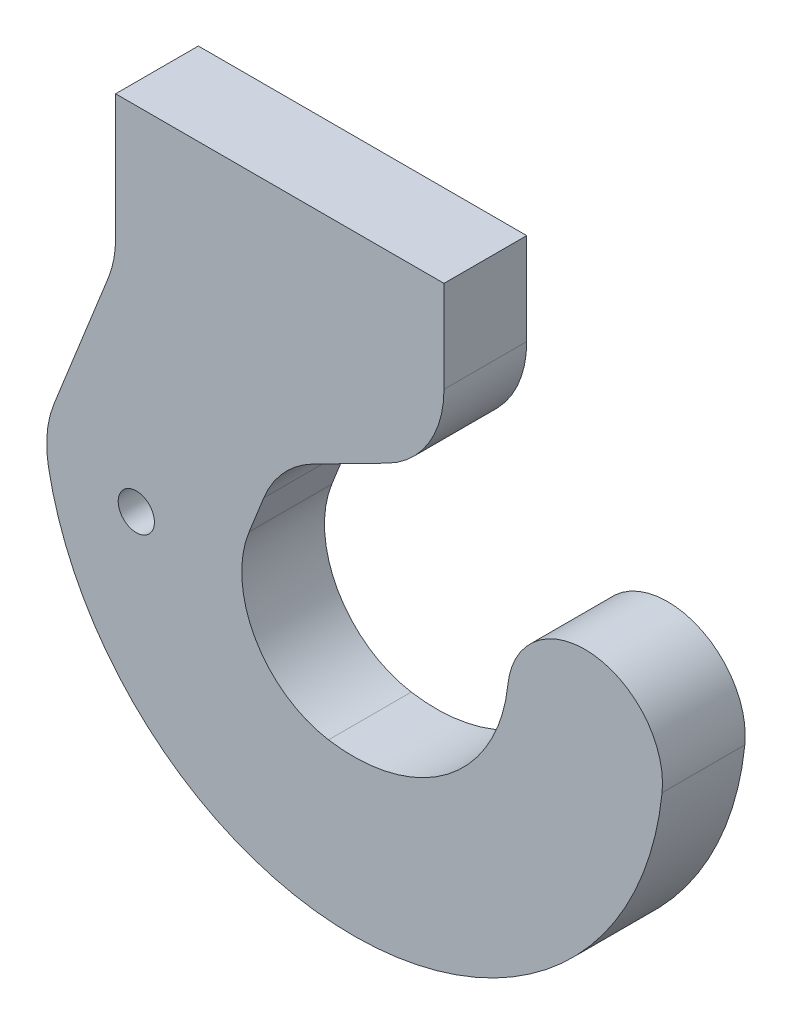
ISO-10303-21;
HEADER;
FILE_DESCRIPTION(('STEP AP214'),'2;1');
FILE_NAME('part.step','',(''),(''),'','','');
FILE_SCHEMA(('AUTOMOTIVE_DESIGN { 1 0 10303 214 1 1 1 1 }'));
ENDSEC;
DATA;
#1=APPLICATION_CONTEXT('core data for automotive mechanical design processes');
#2=APPLICATION_PROTOCOL_DEFINITION('international standard','automotive_design',2000,#1);
#3=PRODUCT_CONTEXT('',#1,'mechanical');
#4=PRODUCT('Part','Part','',(#3));
#5=PRODUCT_RELATED_PRODUCT_CATEGORY('part','',(#4));
#6=PRODUCT_DEFINITION_FORMATION('','',#4);
#7=PRODUCT_DEFINITION_CONTEXT('part definition',#1,'design');
#8=PRODUCT_DEFINITION('design','',#6,#7);
#9=PRODUCT_DEFINITION_SHAPE('','',#8);
#10=(LENGTH_UNIT() NAMED_UNIT(*) SI_UNIT(.MILLI.,.METRE.));
#11=(NAMED_UNIT(*) PLANE_ANGLE_UNIT() SI_UNIT($,.RADIAN.));
#12=(NAMED_UNIT(*) SI_UNIT($,.STERADIAN.) SOLID_ANGLE_UNIT());
#13=UNCERTAINTY_MEASURE_WITH_UNIT(LENGTH_MEASURE(1.E-05),#10,'distance_accuracy_value','');
#14=(GEOMETRIC_REPRESENTATION_CONTEXT(3) GLOBAL_UNCERTAINTY_ASSIGNED_CONTEXT((#13)) GLOBAL_UNIT_ASSIGNED_CONTEXT((#10,
#11,#12)) REPRESENTATION_CONTEXT('',''));
#15=CARTESIAN_POINT('',(0.,0.,0.));
#16=DIRECTION('',(0.,0.,1.));
#17=DIRECTION('',(1.,0.,0.));
#18=AXIS2_PLACEMENT_3D('',#15,#16,#17);
#19=CARTESIAN_POINT('',(8.75000000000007,29.,0.999999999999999));
#20=DIRECTION('',(-1.,0.,0.));
#21=DIRECTION('',(0.,-1.,0.));
#22=AXIS2_PLACEMENT_3D('',#19,#20,#21);
#23=PLANE('',#22);
#24=DIRECTION('',(0.,-1.,0.));
#25=VECTOR('',#24,1.);
#26=CARTESIAN_POINT('',(8.75000000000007,29.,9.));
#27=LINE('',#26,#25);
#28=CARTESIAN_POINT('',(8.75000000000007,29.,9.));
#29=VERTEX_POINT('',#28);
#30=CARTESIAN_POINT('',(8.75000000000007,20.1236294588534,9.));
#31=VERTEX_POINT('',#30);
#32=EDGE_CURVE('E173',#29,#31,#27,.T.);
#33=ORIENTED_EDGE('',*,*,#32,.T.);
#34=DIRECTION('',(0.,0.,1.));
#35=VECTOR('',#34,1.);
#36=CARTESIAN_POINT('',(8.75000000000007,20.1236294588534,0.999999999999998));
#37=LINE('',#36,#35);
#38=CARTESIAN_POINT('',(8.75000000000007,20.1236294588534,0.999999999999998));
#39=VERTEX_POINT('',#38);
#40=EDGE_CURVE('E223',#31,#39,#37,.F.);
#41=ORIENTED_EDGE('',*,*,#40,.T.);
#42=DIRECTION('',(0.,-1.,0.));
#43=VECTOR('',#42,1.);
#44=CARTESIAN_POINT('',(8.75000000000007,29.,0.999999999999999));
#45=LINE('',#44,#43);
#46=CARTESIAN_POINT('',(8.75000000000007,29.,0.999999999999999));
#47=VERTEX_POINT('',#46);
#48=EDGE_CURVE('E194',#47,#39,#45,.T.);
#49=ORIENTED_EDGE('',*,*,#48,.F.);
#50=DIRECTION('',(0.,0.,1.));
#51=VECTOR('',#50,1.);
#52=CARTESIAN_POINT('',(8.75000000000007,29.,0.999999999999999));
#53=LINE('',#52,#51);
#54=EDGE_CURVE('E172',#47,#29,#53,.T.);
#55=ORIENTED_EDGE('',*,*,#54,.T.);
#56=EDGE_LOOP('',(#33,#41,#49,#55));
#57=FACE_BOUND('',#56,.T.);
#58=ADVANCED_FACE('F36',(#57),#23,.F.);
#59=CARTESIAN_POINT('',(-7.2829108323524,5.81796050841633,0.999999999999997));
#60=DIRECTION('',(-0.454557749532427,0.890717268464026,0.));
#61=DIRECTION('',(-0.890717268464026,-0.454557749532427,0.));
#62=AXIS2_PLACEMENT_3D('',#59,#60,#61);
#63=PLANE('',#62);
#64=DIRECTION('',(-0.890717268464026,-0.454557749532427,0.));
#65=VECTOR('',#64,1.);
#66=CARTESIAN_POINT('',(-7.2829108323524,5.81796050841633,0.999999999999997));
#67=LINE('',#66,#65);
#68=CARTESIAN_POINT('',(3.29557749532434,11.2164567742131,0.999999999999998));
#69=VERTEX_POINT('',#68);
#70=CARTESIAN_POINT('',(-3.93249415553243,7.5277711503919,0.999999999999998));
#71=VERTEX_POINT('',#70);
#72=EDGE_CURVE('E286',#69,#71,#67,.T.);
#73=ORIENTED_EDGE('',*,*,#72,.F.);
#74=DIRECTION('',(0.,0.,1.));
#75=VECTOR('',#74,1.);
#76=CARTESIAN_POINT('',(3.29557749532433,11.2164567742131,0.999999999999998));
#77=LINE('',#76,#75);
#78=CARTESIAN_POINT('',(3.29557749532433,11.2164567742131,9.));
#79=VERTEX_POINT('',#78);
#80=EDGE_CURVE('E220',#69,#79,#77,.T.);
#81=ORIENTED_EDGE('',*,*,#80,.T.);
#82=DIRECTION('',(-0.890717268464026,-0.454557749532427,0.));
#83=VECTOR('',#82,1.);
#84=CARTESIAN_POINT('',(-7.2829108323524,5.81796050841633,9.));
#85=LINE('',#84,#83);
#86=CARTESIAN_POINT('',(-3.93249415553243,7.5277711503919,9.));
#87=VERTEX_POINT('',#86);
#88=EDGE_CURVE('E176',#79,#87,#85,.T.);
#89=ORIENTED_EDGE('',*,*,#88,.T.);
#90=DIRECTION('',(0.,0.,1.));
#91=VECTOR('',#90,1.);
#92=CARTESIAN_POINT('',(-3.93249415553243,7.5277711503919,0.999999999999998));
#93=LINE('',#92,#91);
#94=EDGE_CURVE('E218',#87,#71,#93,.F.);
#95=ORIENTED_EDGE('',*,*,#94,.T.);
#96=EDGE_LOOP('',(#73,#81,#89,#95));
#97=FACE_BOUND('',#96,.T.);
#98=ADVANCED_FACE('F258',(#97),#63,.F.);
#99=CARTESIAN_POINT('',(-12.7516213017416,-7.89912363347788,0.999999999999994));
#100=DIRECTION('',(-0.928899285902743,0.370332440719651,0.));
#101=DIRECTION('',(-0.370332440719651,-0.928899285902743,0.));
#102=AXIS2_PLACEMENT_3D('',#99,#100,#101);
#103=PLANE('',#102);
#104=DIRECTION('',(-0.370332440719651,-0.928899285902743,0.));
#105=VECTOR('',#104,1.);
#106=CARTESIAN_POINT('',(-12.7516213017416,-7.89912363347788,0.999999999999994));
#107=LINE('',#106,#105);
#108=CARTESIAN_POINT('',(-8.67590951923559,2.32392287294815,0.999999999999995));
#109=VERTEX_POINT('',#108);
#110=CARTESIAN_POINT('',(-10.093398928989,-1.23154447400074,0.999999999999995));
#111=VERTEX_POINT('',#110);
#112=EDGE_CURVE('E145',#109,#111,#107,.T.);
#113=ORIENTED_EDGE('',*,*,#112,.F.);
#114=DIRECTION('',(0.,0.,1.));
#115=VECTOR('',#114,1.);
#116=CARTESIAN_POINT('',(-8.67590951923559,2.32392287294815,8.99999999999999));
#117=LINE('',#116,#115);
#118=CARTESIAN_POINT('',(-8.67590951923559,2.32392287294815,9.));
#119=VERTEX_POINT('',#118);
#120=EDGE_CURVE('E226',#109,#119,#117,.T.);
#121=ORIENTED_EDGE('',*,*,#120,.T.);
#122=DIRECTION('',(-0.370332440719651,-0.928899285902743,0.));
#123=VECTOR('',#122,1.);
#124=CARTESIAN_POINT('',(-12.7516213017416,-7.89912363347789,8.99999999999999));
#125=LINE('',#124,#123);
#126=CARTESIAN_POINT('',(-10.093398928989,-1.23154447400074,8.99999999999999));
#127=VERTEX_POINT('',#126);
#128=EDGE_CURVE('E179',#119,#127,#125,.T.);
#129=ORIENTED_EDGE('',*,*,#128,.T.);
#130=DIRECTION('',(0.,0.,-1.));
#131=VECTOR('',#130,1.);
#132=CARTESIAN_POINT('',(-10.093398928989,-1.23154447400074,0.999999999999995));
#133=LINE('',#132,#131);
#134=EDGE_CURVE('E58',#127,#111,#133,.T.);
#135=ORIENTED_EDGE('',*,*,#134,.T.);
#136=EDGE_LOOP('',(#113,#121,#129,#135));
#137=FACE_BOUND('',#136,.T.);
#138=ADVANCED_FACE('F244',(#137),#103,.F.);
#139=CARTESIAN_POINT('',(0.,0.,0.999999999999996));
#140=DIRECTION('',(0.,0.,1.));
#141=DIRECTION('',(0.,-1.,0.));
#142=AXIS2_PLACEMENT_3D('',#139,#140,#141);
#143=CYLINDRICAL_SURFACE('',#142,15.);
#144=CARTESIAN_POINT('',(0.,0.,0.999999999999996));
#145=DIRECTION('',(0.,0.,1.));
#146=DIRECTION('',(0.,1.,0.));
#147=AXIS2_PLACEMENT_3D('',#144,#145,#146);
#148=CIRCLE('',#147,15.);
#149=CARTESIAN_POINT('',(-2.41321820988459,-14.8046066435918,0.999999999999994));
#150=VERTEX_POINT('',#149);
#151=CARTESIAN_POINT('',(14.9193145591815,-1.5537223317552,0.999999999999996));
#152=VERTEX_POINT('',#151);
#153=EDGE_CURVE('E135',#150,#152,#148,.T.);
#154=ORIENTED_EDGE('',*,*,#153,.F.);
#155=DIRECTION('',(0.,0.,1.));
#156=VECTOR('',#155,1.);
#157=CARTESIAN_POINT('',(-2.41321820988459,-14.8046066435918,0.999999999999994));
#158=LINE('',#157,#156);
#159=CARTESIAN_POINT('',(-2.41321820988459,-14.8046066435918,8.99999999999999));
#160=VERTEX_POINT('',#159);
#161=EDGE_CURVE('E229',#150,#160,#158,.T.);
#162=ORIENTED_EDGE('',*,*,#161,.T.);
#163=CARTESIAN_POINT('',(0.,0.,9.));
#164=DIRECTION('',(0.,0.,1.));
#165=DIRECTION('',(0.,1.,0.));
#166=AXIS2_PLACEMENT_3D('',#163,#164,#165);
#167=CIRCLE('',#166,15.);
#168=CARTESIAN_POINT('',(14.9193145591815,-1.5537223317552,9.));
#169=VERTEX_POINT('',#168);
#170=EDGE_CURVE('E151',#160,#169,#167,.T.);
#171=ORIENTED_EDGE('',*,*,#170,.T.);
#172=DIRECTION('',(0.,0.,1.));
#173=VECTOR('',#172,1.);
#174=CARTESIAN_POINT('',(14.9193145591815,-1.5537223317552,0.999999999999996));
#175=LINE('',#174,#173);
#176=EDGE_CURVE('E148',#152,#169,#175,.T.);
#177=ORIENTED_EDGE('',*,*,#176,.F.);
#178=EDGE_LOOP('',(#154,#162,#171,#177));
#179=FACE_BOUND('',#178,.T.);
#180=ADVANCED_FACE('F149',(#179),#143,.F.);
#181=CARTESIAN_POINT('',(22.3789718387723,-2.33058349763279,0.999999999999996));
#182=DIRECTION('',(0.,0.,1.));
#183=DIRECTION('',(0.,-1.,0.));
#184=AXIS2_PLACEMENT_3D('',#181,#182,#183);
#185=CYLINDRICAL_SURFACE('',#184,7.5);
#186=CARTESIAN_POINT('',(22.3789718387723,-2.33058349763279,9.));
#187=DIRECTION('',(0.,0.,-1.));
#188=DIRECTION('',(0.,1.,0.));
#189=AXIS2_PLACEMENT_3D('',#186,#187,#188);
#190=CIRCLE('',#189,7.5);
#191=CARTESIAN_POINT('',(29.838629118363,-3.10744466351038,9.));
#192=VERTEX_POINT('',#191);
#193=EDGE_CURVE('E182',#169,#192,#190,.T.);
#194=ORIENTED_EDGE('',*,*,#193,.T.);
#195=DIRECTION('',(0.,0.,1.));
#196=VECTOR('',#195,1.);
#197=CARTESIAN_POINT('',(29.838629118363,-3.10744466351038,0.999999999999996));
#198=LINE('',#197,#196);
#199=CARTESIAN_POINT('',(29.838629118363,-3.10744466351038,0.999999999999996));
#200=VERTEX_POINT('',#199);
#201=EDGE_CURVE('E155',#200,#192,#198,.T.);
#202=ORIENTED_EDGE('',*,*,#201,.F.);
#203=CARTESIAN_POINT('',(22.3789718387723,-2.33058349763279,0.999999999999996));
#204=DIRECTION('',(0.,0.,-1.));
#205=DIRECTION('',(0.,1.,0.));
#206=AXIS2_PLACEMENT_3D('',#203,#204,#205);
#207=CIRCLE('',#206,7.5);
#208=EDGE_CURVE('E140',#152,#200,#207,.T.);
#209=ORIENTED_EDGE('',*,*,#208,.F.);
#210=ORIENTED_EDGE('',*,*,#176,.T.);
#211=EDGE_LOOP('',(#194,#202,#209,#210));
#212=FACE_BOUND('',#211,.T.);
#213=ADVANCED_FACE('F157',(#212),#185,.T.);
#214=CARTESIAN_POINT('',(0.,0.,0.999999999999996));
#215=DIRECTION('',(0.,0.,1.));
#216=DIRECTION('',(0.,-1.,0.));
#217=AXIS2_PLACEMENT_3D('',#214,#215,#216);
#218=CYLINDRICAL_SURFACE('',#217,30.);
#219=CARTESIAN_POINT('',(0.,0.,9.));
#220=DIRECTION('',(0.,0.,-1.));
#221=DIRECTION('',(0.,1.,0.));
#222=AXIS2_PLACEMENT_3D('',#219,#220,#221);
#223=CIRCLE('',#222,30.);
#224=CARTESIAN_POINT('',(-29.4989427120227,-5.46007132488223,9.));
#225=VERTEX_POINT('',#224);
#226=EDGE_CURVE('E184',#192,#225,#223,.T.);
#227=ORIENTED_EDGE('',*,*,#226,.T.);
#228=DIRECTION('',(0.,0.,1.));
#229=VECTOR('',#228,1.);
#230=CARTESIAN_POINT('',(-29.4989427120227,-5.46007132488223,0.999999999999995));
#231=LINE('',#230,#229);
#232=CARTESIAN_POINT('',(-29.4989427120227,-5.46007132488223,0.999999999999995));
#233=VERTEX_POINT('',#232);
#234=EDGE_CURVE('E212',#225,#233,#231,.F.);
#235=ORIENTED_EDGE('',*,*,#234,.T.);
#236=CARTESIAN_POINT('',(0.,0.,0.999999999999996));
#237=DIRECTION('',(0.,0.,-1.));
#238=DIRECTION('',(0.,1.,0.));
#239=AXIS2_PLACEMENT_3D('',#236,#237,#238);
#240=CIRCLE('',#239,30.);
#241=EDGE_CURVE('E160',#200,#233,#240,.T.);
#242=ORIENTED_EDGE('',*,*,#241,.F.);
#243=ORIENTED_EDGE('',*,*,#201,.T.);
#244=EDGE_LOOP('',(#227,#235,#242,#243));
#245=FACE_BOUND('',#244,.T.);
#246=ADVANCED_FACE('F320',(#245),#218,.T.);
#247=CARTESIAN_POINT('',(-29.9093360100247,-2.33058349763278,0.999999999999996));
#248=DIRECTION('',(0.928899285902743,-0.370332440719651,0.));
#249=DIRECTION('',(0.370332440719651,0.928899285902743,0.));
#250=AXIS2_PLACEMENT_3D('',#247,#248,#249);
#251=PLANE('',#250);
#252=DIRECTION('',(0.370332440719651,0.928899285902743,0.));
#253=VECTOR('',#252,1.);
#254=CARTESIAN_POINT('',(-29.9093360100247,-2.33058349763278,9.));
#255=LINE('',#254,#253);
#256=CARTESIAN_POINT('',(-28.9549546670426,0.0632768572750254,9.));
#257=VERTEX_POINT('',#256);
#258=CARTESIAN_POINT('',(-23.7110071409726,13.216591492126,9.));
#259=VERTEX_POINT('',#258);
#260=EDGE_CURVE('E187',#257,#259,#255,.T.);
#261=ORIENTED_EDGE('',*,*,#260,.T.);
#262=DIRECTION('',(0.,0.,1.));
#263=VECTOR('',#262,1.);
#264=CARTESIAN_POINT('',(-23.7110071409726,13.216591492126,0.999999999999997));
#265=LINE('',#264,#263);
#266=CARTESIAN_POINT('',(-23.7110071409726,13.216591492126,0.999999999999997));
#267=VERTEX_POINT('',#266);
#268=EDGE_CURVE('E206',#259,#267,#265,.F.);
#269=ORIENTED_EDGE('',*,*,#268,.T.);
#270=DIRECTION('',(0.370332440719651,0.928899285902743,0.));
#271=VECTOR('',#270,1.);
#272=CARTESIAN_POINT('',(-29.9093360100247,-2.33058349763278,0.999999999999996));
#273=LINE('',#272,#271);
#274=CARTESIAN_POINT('',(-28.9549546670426,0.0632768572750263,0.999999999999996));
#275=VERTEX_POINT('',#274);
#276=EDGE_CURVE('E162',#275,#267,#273,.T.);
#277=ORIENTED_EDGE('',*,*,#276,.F.);
#278=DIRECTION('',(0.,0.,1.));
#279=VECTOR('',#278,1.);
#280=CARTESIAN_POINT('',(-28.9549546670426,0.0632768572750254,0.999999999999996));
#281=LINE('',#280,#279);
#282=EDGE_CURVE('E203',#275,#257,#281,.T.);
#283=ORIENTED_EDGE('',*,*,#282,.T.);
#284=EDGE_LOOP('',(#261,#269,#277,#283));
#285=FACE_BOUND('',#284,.T.);
#286=ADVANCED_FACE('F316',(#285),#251,.F.);
#287=CARTESIAN_POINT('',(-23.,29.,0.999999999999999));
#288=DIRECTION('',(1.,0.,0.));
#289=DIRECTION('',(0.,0.,-1.));
#290=AXIS2_PLACEMENT_3D('',#287,#288,#289);
#291=PLANE('',#290);
#292=DIRECTION('',(0.,1.,0.));
#293=VECTOR('',#292,1.);
#294=CARTESIAN_POINT('',(-23.,29.,0.999999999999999));
#295=LINE('',#294,#293);
#296=CARTESIAN_POINT('',(-23.,16.9199158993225,0.999999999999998));
#297=VERTEX_POINT('',#296);
#298=CARTESIAN_POINT('',(-23.,29.,0.999999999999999));
#299=VERTEX_POINT('',#298);
#300=EDGE_CURVE('E168',#297,#299,#295,.T.);
#301=ORIENTED_EDGE('',*,*,#300,.F.);
#302=DIRECTION('',(0.,0.,1.));
#303=VECTOR('',#302,1.);
#304=CARTESIAN_POINT('',(-23.,16.9199158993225,9.));
#305=LINE('',#304,#303);
#306=CARTESIAN_POINT('',(-23.,16.9199158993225,9.));
#307=VERTEX_POINT('',#306);
#308=EDGE_CURVE('E154',#297,#307,#305,.T.);
#309=ORIENTED_EDGE('',*,*,#308,.T.);
#310=DIRECTION('',(0.,1.,0.));
#311=VECTOR('',#310,1.);
#312=CARTESIAN_POINT('',(-23.,29.,9.));
#313=LINE('',#312,#311);
#314=CARTESIAN_POINT('',(-23.,29.,9.));
#315=VERTEX_POINT('',#314);
#316=EDGE_CURVE('E190',#307,#315,#313,.T.);
#317=ORIENTED_EDGE('',*,*,#316,.T.);
#318=DIRECTION('',(0.,0.,1.));
#319=VECTOR('',#318,1.);
#320=CARTESIAN_POINT('',(-23.,29.,0.999999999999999));
#321=LINE('',#320,#319);
#322=EDGE_CURVE('E197',#299,#315,#321,.T.);
#323=ORIENTED_EDGE('',*,*,#322,.F.);
#324=EDGE_LOOP('',(#301,#309,#317,#323));
#325=FACE_BOUND('',#324,.T.);
#326=ADVANCED_FACE('F312',(#325),#291,.F.);
#327=CARTESIAN_POINT('',(8.75000000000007,29.,0.999999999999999));
#328=DIRECTION('',(0.,-1.,0.));
#329=DIRECTION('',(0.,0.,-1.));
#330=AXIS2_PLACEMENT_3D('',#327,#328,#329);
#331=PLANE('',#330);
#332=DIRECTION('',(1.,0.,0.));
#333=VECTOR('',#332,1.);
#334=CARTESIAN_POINT('',(8.75000000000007,29.,9.));
#335=LINE('',#334,#333);
#336=EDGE_CURVE('E192',#315,#29,#335,.T.);
#337=ORIENTED_EDGE('',*,*,#336,.T.);
#338=ORIENTED_EDGE('',*,*,#54,.F.);
#339=DIRECTION('',(1.,0.,0.));
#340=VECTOR('',#339,1.);
#341=CARTESIAN_POINT('',(8.75000000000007,29.,0.999999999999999));
#342=LINE('',#341,#340);
#343=EDGE_CURVE('E170',#299,#47,#342,.T.);
#344=ORIENTED_EDGE('',*,*,#343,.F.);
#345=ORIENTED_EDGE('',*,*,#322,.T.);
#346=EDGE_LOOP('',(#337,#338,#344,#345));
#347=FACE_BOUND('',#346,.T.);
#348=ADVANCED_FACE('F307',(#347),#331,.F.);
#349=CARTESIAN_POINT('',(0.,0.,0.999999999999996));
#350=DIRECTION('',(0.,0.,-1.));
#351=DIRECTION('',(0.,1.,0.));
#352=AXIS2_PLACEMENT_3D('',#349,#350,#351);
#353=PLANE('',#352);
#354=CARTESIAN_POINT('',(-21.,-5.,0.999999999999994));
#355=DIRECTION('',(0.,0.,1.));
#356=DIRECTION('',(1.,0.,0.));
#357=AXIS2_PLACEMENT_3D('',#354,#355,#356);
#358=CIRCLE('',#357,1.75);
#359=CARTESIAN_POINT('',(-19.25,-5.,0.999999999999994));
#360=VERTEX_POINT('',#359);
#361=EDGE_CURVE('E294',#360,#360,#358,.T.);
#362=ORIENTED_EDGE('',*,*,#361,.T.);
#363=EDGE_LOOP('',(#362));
#364=FACE_BOUND('',#363,.T.);
#365=ORIENTED_EDGE('',*,*,#241,.T.);
#366=CARTESIAN_POINT('',(-19.6659618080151,-3.64004754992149,0.999999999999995));
#367=DIRECTION('',(0.,0.,-1.));
#368=DIRECTION('',(0.,1.,0.));
#369=AXIS2_PLACEMENT_3D('',#366,#367,#368);
#370=CIRCLE('',#369,10.);
#371=EDGE_CURVE('E216',#233,#275,#370,.T.);
#372=ORIENTED_EDGE('',*,*,#371,.T.);
#373=ORIENTED_EDGE('',*,*,#276,.T.);
#374=CARTESIAN_POINT('',(-33.,16.9199158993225,0.999999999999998));
#375=DIRECTION('',(0.,0.,-1.));
#376=DIRECTION('',(0.,1.,0.));
#377=AXIS2_PLACEMENT_3D('',#374,#375,#376);
#378=CIRCLE('',#377,10.);
#379=EDGE_CURVE('E233',#267,#297,#378,.F.);
#380=ORIENTED_EDGE('',*,*,#379,.T.);
#381=ORIENTED_EDGE('',*,*,#300,.T.);
#382=ORIENTED_EDGE('',*,*,#343,.T.);
#383=ORIENTED_EDGE('',*,*,#48,.T.);
#384=CARTESIAN_POINT('',(-1.24999999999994,20.1236294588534,0.999999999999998));
#385=DIRECTION('',(0.,0.,-1.));
#386=DIRECTION('',(0.,1.,0.));
#387=AXIS2_PLACEMENT_3D('',#384,#385,#386);
#388=CIRCLE('',#387,10.);
#389=EDGE_CURVE('E214',#39,#69,#388,.T.);
#390=ORIENTED_EDGE('',*,*,#389,.T.);
#391=ORIENTED_EDGE('',*,*,#72,.T.);
#392=CARTESIAN_POINT('',(0.613083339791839,-1.37940153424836,0.999999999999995));
#393=DIRECTION('',(0.,0.,-1.));
#394=DIRECTION('',(0.,1.,0.));
#395=AXIS2_PLACEMENT_3D('',#392,#393,#394);
#396=CIRCLE('',#395,10.);
#397=EDGE_CURVE('E237',#71,#109,#396,.F.);
#398=ORIENTED_EDGE('',*,*,#397,.T.);
#399=ORIENTED_EDGE('',*,*,#112,.T.);
#400=CARTESIAN_POINT('',(-0.80440606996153,-4.93486888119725,0.999999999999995));
#401=DIRECTION('',(0.,0.,-1.));
#402=DIRECTION('',(0.,1.,0.));
#403=AXIS2_PLACEMENT_3D('',#400,#401,#402);
#404=CIRCLE('',#403,10.);
#405=EDGE_CURVE('E11',#111,#150,#404,.F.);
#406=ORIENTED_EDGE('',*,*,#405,.T.);
#407=ORIENTED_EDGE('',*,*,#153,.T.);
#408=ORIENTED_EDGE('',*,*,#208,.T.);
#409=EDGE_LOOP('',(#365,#372,#373,#380,#381,#382,#383,#390,#391,#398,#399,#406,#407,#408));
#410=FACE_BOUND('',#409,.T.);
#411=ADVANCED_FACE('F138',(#364,#410),#353,.T.);
#412=CARTESIAN_POINT('',(0.,0.,9.));
#413=DIRECTION('',(0.,0.,-1.));
#414=DIRECTION('',(0.,1.,0.));
#415=AXIS2_PLACEMENT_3D('',#412,#413,#414);
#416=PLANE('',#415);
#417=CARTESIAN_POINT('',(-21.,-5.,9.));
#418=DIRECTION('',(0.,0.,-1.));
#419=DIRECTION('',(0.,1.,0.));
#420=AXIS2_PLACEMENT_3D('',#417,#418,#419);
#421=CIRCLE('',#420,1.75);
#422=CARTESIAN_POINT('',(-21.,-3.25,9.));
#423=VERTEX_POINT('',#422);
#424=EDGE_CURVE('E40',#423,#423,#421,.T.);
#425=ORIENTED_EDGE('',*,*,#424,.T.);
#426=EDGE_LOOP('',(#425));
#427=FACE_BOUND('',#426,.T.);
#428=ORIENTED_EDGE('',*,*,#260,.F.);
#429=CARTESIAN_POINT('',(-19.6659618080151,-3.64004754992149,9.));
#430=DIRECTION('',(0.,0.,-1.));
#431=DIRECTION('',(0.,1.,0.));
#432=AXIS2_PLACEMENT_3D('',#429,#430,#431);
#433=CIRCLE('',#432,10.);
#434=EDGE_CURVE('E210',#257,#225,#433,.F.);
#435=ORIENTED_EDGE('',*,*,#434,.T.);
#436=ORIENTED_EDGE('',*,*,#226,.F.);
#437=ORIENTED_EDGE('',*,*,#193,.F.);
#438=ORIENTED_EDGE('',*,*,#170,.F.);
#439=CARTESIAN_POINT('',(-0.80440606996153,-4.93486888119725,9.));
#440=DIRECTION('',(0.,0.,-1.));
#441=DIRECTION('',(0.,1.,0.));
#442=AXIS2_PLACEMENT_3D('',#439,#440,#441);
#443=CIRCLE('',#442,10.);
#444=EDGE_CURVE('E45',#160,#127,#443,.T.);
#445=ORIENTED_EDGE('',*,*,#444,.T.);
#446=ORIENTED_EDGE('',*,*,#128,.F.);
#447=CARTESIAN_POINT('',(0.613083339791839,-1.37940153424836,8.99999999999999));
#448=DIRECTION('',(0.,0.,-1.));
#449=DIRECTION('',(0.,1.,0.));
#450=AXIS2_PLACEMENT_3D('',#447,#448,#449);
#451=CIRCLE('',#450,10.);
#452=EDGE_CURVE('E235',#119,#87,#451,.T.);
#453=ORIENTED_EDGE('',*,*,#452,.T.);
#454=ORIENTED_EDGE('',*,*,#88,.F.);
#455=CARTESIAN_POINT('',(-1.24999999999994,20.1236294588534,9.));
#456=DIRECTION('',(0.,0.,-1.));
#457=DIRECTION('',(0.,1.,0.));
#458=AXIS2_PLACEMENT_3D('',#455,#456,#457);
#459=CIRCLE('',#458,10.);
#460=EDGE_CURVE('E208',#79,#31,#459,.F.);
#461=ORIENTED_EDGE('',*,*,#460,.T.);
#462=ORIENTED_EDGE('',*,*,#32,.F.);
#463=ORIENTED_EDGE('',*,*,#336,.F.);
#464=ORIENTED_EDGE('',*,*,#316,.F.);
#465=CARTESIAN_POINT('',(-33.,16.9199158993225,9.));
#466=DIRECTION('',(0.,0.,-1.));
#467=DIRECTION('',(0.,1.,0.));
#468=AXIS2_PLACEMENT_3D('',#465,#466,#467);
#469=CIRCLE('',#468,10.);
#470=EDGE_CURVE('E231',#307,#259,#469,.T.);
#471=ORIENTED_EDGE('',*,*,#470,.T.);
#472=EDGE_LOOP('',(#428,#435,#436,#437,#438,#445,#446,#453,#454,#461,#462,#463,#464,#471));
#473=FACE_BOUND('',#472,.T.);
#474=ADVANCED_FACE('F242',(#427,#473),#416,.F.);
#475=CARTESIAN_POINT('',(-33.,16.9199158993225,0.999999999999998));
#476=DIRECTION('',(0.,0.,-1.));
#477=DIRECTION('',(0.,1.,0.));
#478=AXIS2_PLACEMENT_3D('',#475,#476,#477);
#479=CYLINDRICAL_SURFACE('',#478,10.);
#480=ORIENTED_EDGE('',*,*,#379,.F.);
#481=ORIENTED_EDGE('',*,*,#268,.F.);
#482=ORIENTED_EDGE('',*,*,#470,.F.);
#483=ORIENTED_EDGE('',*,*,#308,.F.);
#484=EDGE_LOOP('',(#480,#481,#482,#483));
#485=FACE_BOUND('',#484,.T.);
#486=ADVANCED_FACE('F268',(#485),#479,.F.);
#487=CARTESIAN_POINT('',(-19.6659618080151,-3.64004754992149,0.999999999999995));
#488=DIRECTION('',(0.,0.,1.));
#489=DIRECTION('',(0.,-1.,0.));
#490=AXIS2_PLACEMENT_3D('',#487,#488,#489);
#491=CYLINDRICAL_SURFACE('',#490,10.);
#492=ORIENTED_EDGE('',*,*,#371,.F.);
#493=ORIENTED_EDGE('',*,*,#234,.F.);
#494=ORIENTED_EDGE('',*,*,#434,.F.);
#495=ORIENTED_EDGE('',*,*,#282,.F.);
#496=EDGE_LOOP('',(#492,#493,#494,#495));
#497=FACE_BOUND('',#496,.T.);
#498=ADVANCED_FACE('F271',(#497),#491,.T.);
#499=CARTESIAN_POINT('',(-1.24999999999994,20.1236294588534,0.999999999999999));
#500=DIRECTION('',(0.,0.,1.));
#501=DIRECTION('',(0.,-1.,0.));
#502=AXIS2_PLACEMENT_3D('',#499,#500,#501);
#503=CYLINDRICAL_SURFACE('',#502,10.);
#504=ORIENTED_EDGE('',*,*,#389,.F.);
#505=ORIENTED_EDGE('',*,*,#40,.F.);
#506=ORIENTED_EDGE('',*,*,#460,.F.);
#507=ORIENTED_EDGE('',*,*,#80,.F.);
#508=EDGE_LOOP('',(#504,#505,#506,#507));
#509=FACE_BOUND('',#508,.T.);
#510=ADVANCED_FACE('F255',(#509),#503,.T.);
#511=CARTESIAN_POINT('',(0.613083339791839,-1.37940153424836,0.999999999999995));
#512=DIRECTION('',(0.,0.,-1.));
#513=DIRECTION('',(0.,1.,0.));
#514=AXIS2_PLACEMENT_3D('',#511,#512,#513);
#515=CYLINDRICAL_SURFACE('',#514,10.);
#516=ORIENTED_EDGE('',*,*,#397,.F.);
#517=ORIENTED_EDGE('',*,*,#94,.F.);
#518=ORIENTED_EDGE('',*,*,#452,.F.);
#519=ORIENTED_EDGE('',*,*,#120,.F.);
#520=EDGE_LOOP('',(#516,#517,#518,#519));
#521=FACE_BOUND('',#520,.T.);
#522=ADVANCED_FACE('F248',(#521),#515,.F.);
#523=CARTESIAN_POINT('',(-0.80440606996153,-4.93486888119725,0.999999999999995));
#524=DIRECTION('',(0.,0.,1.));
#525=DIRECTION('',(0.,-1.,0.));
#526=AXIS2_PLACEMENT_3D('',#523,#524,#525);
#527=CYLINDRICAL_SURFACE('',#526,10.);
#528=ORIENTED_EDGE('',*,*,#405,.F.);
#529=ORIENTED_EDGE('',*,*,#134,.F.);
#530=ORIENTED_EDGE('',*,*,#444,.F.);
#531=ORIENTED_EDGE('',*,*,#161,.F.);
#532=EDGE_LOOP('',(#528,#529,#530,#531));
#533=FACE_BOUND('',#532,.T.);
#534=ADVANCED_FACE('F38',(#533),#527,.F.);
#535=CARTESIAN_POINT('',(-21.,-5.,0.999999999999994));
#536=DIRECTION('',(0.,0.,1.));
#537=DIRECTION('',(1.,0.,0.));
#538=AXIS2_PLACEMENT_3D('',#535,#536,#537);
#539=CYLINDRICAL_SURFACE('',#538,1.75);
#540=ORIENTED_EDGE('',*,*,#361,.F.);
#541=EDGE_LOOP('',(#540));
#542=FACE_BOUND('',#541,.T.);
#543=ORIENTED_EDGE('',*,*,#424,.F.);
#544=EDGE_LOOP('',(#543));
#545=FACE_BOUND('',#544,.T.);
#546=ADVANCED_FACE('F247',(#542,#545),#539,.F.);
#547=CLOSED_SHELL('',(#58,#98,#138,#180,#213,#246,#286,#326,#348,#411,#474,#486,#498,#510,#522,
#534,#546));
#548=MANIFOLD_SOLID_BREP('B2',#547);
#549=ADVANCED_BREP_SHAPE_REPRESENTATION('',(#18,#548),#14);
#550=SHAPE_DEFINITION_REPRESENTATION(#9,#549);
ENDSEC;
END-ISO-10303-21;
